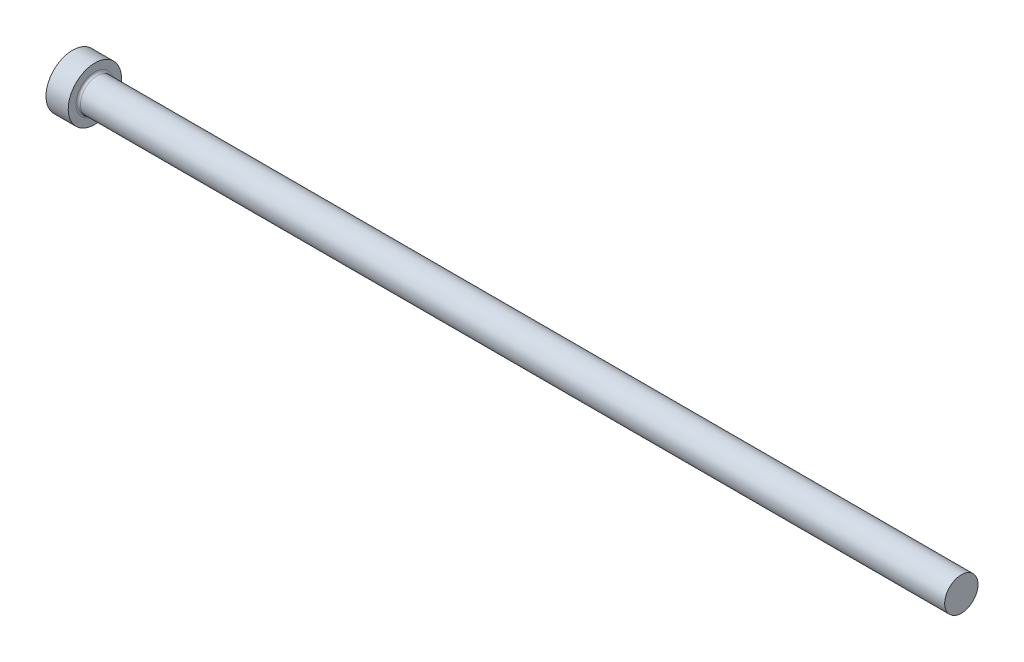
ISO-10303-21;
HEADER;
FILE_DESCRIPTION(('STEP AP214'),'2;1');
FILE_NAME('part.step','',(''),(''),'','','');
FILE_SCHEMA(('AUTOMOTIVE_DESIGN { 1 0 10303 214 1 1 1 1 }'));
ENDSEC;
DATA;
#1=APPLICATION_CONTEXT('core data for automotive mechanical design processes');
#2=APPLICATION_PROTOCOL_DEFINITION('international standard','automotive_design',2000,#1);
#3=PRODUCT_CONTEXT('',#1,'mechanical');
#4=PRODUCT('Part','Part','',(#3));
#5=PRODUCT_RELATED_PRODUCT_CATEGORY('part','',(#4));
#6=PRODUCT_DEFINITION_FORMATION('','',#4);
#7=PRODUCT_DEFINITION_CONTEXT('part definition',#1,'design');
#8=PRODUCT_DEFINITION('design','',#6,#7);
#9=PRODUCT_DEFINITION_SHAPE('','',#8);
#10=(LENGTH_UNIT() NAMED_UNIT(*) SI_UNIT(.MILLI.,.METRE.));
#11=(NAMED_UNIT(*) PLANE_ANGLE_UNIT() SI_UNIT($,.RADIAN.));
#12=(NAMED_UNIT(*) SI_UNIT($,.STERADIAN.) SOLID_ANGLE_UNIT());
#13=UNCERTAINTY_MEASURE_WITH_UNIT(LENGTH_MEASURE(1.E-05),#10,'distance_accuracy_value','');
#14=(GEOMETRIC_REPRESENTATION_CONTEXT(3) GLOBAL_UNCERTAINTY_ASSIGNED_CONTEXT((#13)) GLOBAL_UNIT_ASSIGNED_CONTEXT((#10,
#11,#12)) REPRESENTATION_CONTEXT('',''));
#15=CARTESIAN_POINT('',(0.,0.,0.));
#16=DIRECTION('',(0.,0.,1.));
#17=DIRECTION('',(1.,0.,0.));
#18=AXIS2_PLACEMENT_3D('',#15,#16,#17);
#19=CARTESIAN_POINT('',(0.,0.,0.));
#20=DIRECTION('',(-1.,0.,0.));
#21=DIRECTION('',(0.,-1.,0.));
#22=AXIS2_PLACEMENT_3D('',#19,#20,#21);
#23=PLANE('',#22);
#24=CARTESIAN_POINT('',(0.,0.,0.));
#25=DIRECTION('',(1.,0.,0.));
#26=DIRECTION('',(0.,1.,0.));
#27=AXIS2_PLACEMENT_3D('',#24,#25,#26);
#28=CIRCLE('',#27,6.);
#29=CARTESIAN_POINT('',(0.,6.,0.));
#30=VERTEX_POINT('',#29);
#31=EDGE_CURVE('E25',#30,#30,#28,.T.);
#32=ORIENTED_EDGE('',*,*,#31,.F.);
#33=EDGE_LOOP('',(#32));
#34=FACE_BOUND('',#33,.T.);
#35=ADVANCED_FACE('F14',(#34),#23,.T.);
#36=CARTESIAN_POINT('',(200.,0.,0.));
#37=DIRECTION('',(1.,0.,0.));
#38=DIRECTION('',(0.,1.,0.));
#39=AXIS2_PLACEMENT_3D('',#36,#37,#38);
#40=CYLINDRICAL_SURFACE('',#39,6.);
#41=ORIENTED_EDGE('',*,*,#31,.T.);
#42=EDGE_LOOP('',(#41));
#43=FACE_BOUND('',#42,.T.);
#44=CARTESIAN_POINT('',(5.,0.,0.));
#45=DIRECTION('',(1.,0.,0.));
#46=DIRECTION('',(0.,1.,0.));
#47=AXIS2_PLACEMENT_3D('',#44,#45,#46);
#48=CIRCLE('',#47,6.);
#49=CARTESIAN_POINT('',(5.,6.,0.));
#50=VERTEX_POINT('',#49);
#51=EDGE_CURVE('E29',#50,#50,#48,.T.);
#52=ORIENTED_EDGE('',*,*,#51,.F.);
#53=EDGE_LOOP('',(#52));
#54=FACE_BOUND('',#53,.T.);
#55=ADVANCED_FACE('F51',(#43,#54),#40,.T.);
#56=CARTESIAN_POINT('',(5.,6.,0.));
#57=DIRECTION('',(1.,0.,0.));
#58=DIRECTION('',(0.,1.,0.));
#59=AXIS2_PLACEMENT_3D('',#56,#57,#58);
#60=PLANE('',#59);
#61=CARTESIAN_POINT('',(5.,0.,0.));
#62=DIRECTION('',(1.,0.,0.));
#63=DIRECTION('',(0.,1.,0.));
#64=AXIS2_PLACEMENT_3D('',#61,#62,#63);
#65=CIRCLE('',#64,4.24999999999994);
#66=CARTESIAN_POINT('',(5.,4.24999999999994,0.));
#67=VERTEX_POINT('',#66);
#68=EDGE_CURVE('E9',#67,#67,#65,.F.);
#69=ORIENTED_EDGE('',*,*,#68,.T.);
#70=EDGE_LOOP('',(#69));
#71=FACE_BOUND('',#70,.T.);
#72=ORIENTED_EDGE('',*,*,#51,.T.);
#73=EDGE_LOOP('',(#72));
#74=FACE_BOUND('',#73,.T.);
#75=ADVANCED_FACE('F42',(#71,#74),#60,.T.);
#76=CARTESIAN_POINT('',(200.,0.,0.));
#77=DIRECTION('',(1.,0.,0.));
#78=DIRECTION('',(0.,1.,0.));
#79=AXIS2_PLACEMENT_3D('',#76,#77,#78);
#80=CYLINDRICAL_SURFACE('',#79,3.74999999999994);
#81=CARTESIAN_POINT('',(5.5,0.,0.));
#82=DIRECTION('',(1.,0.,0.));
#83=DIRECTION('',(0.,1.,0.));
#84=AXIS2_PLACEMENT_3D('',#81,#82,#83);
#85=CIRCLE('',#84,3.74999999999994);
#86=CARTESIAN_POINT('',(5.5,3.74999999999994,0.));
#87=VERTEX_POINT('',#86);
#88=EDGE_CURVE('E21',#87,#87,#85,.T.);
#89=ORIENTED_EDGE('',*,*,#88,.T.);
#90=EDGE_LOOP('',(#89));
#91=FACE_BOUND('',#90,.T.);
#92=CARTESIAN_POINT('',(200.,0.,0.));
#93=DIRECTION('',(1.,0.,0.));
#94=DIRECTION('',(0.,1.,0.));
#95=AXIS2_PLACEMENT_3D('',#92,#93,#94);
#96=CIRCLE('',#95,3.75);
#97=CARTESIAN_POINT('',(200.,3.75,0.));
#98=VERTEX_POINT('',#97);
#99=EDGE_CURVE('E34',#98,#98,#96,.T.);
#100=ORIENTED_EDGE('',*,*,#99,.F.);
#101=EDGE_LOOP('',(#100));
#102=FACE_BOUND('',#101,.T.);
#103=ADVANCED_FACE('F40',(#91,#102),#80,.T.);
#104=CARTESIAN_POINT('',(200.,3.75,0.));
#105=DIRECTION('',(1.,0.,0.));
#106=DIRECTION('',(0.,1.,0.));
#107=AXIS2_PLACEMENT_3D('',#104,#105,#106);
#108=PLANE('',#107);
#109=ORIENTED_EDGE('',*,*,#99,.T.);
#110=EDGE_LOOP('',(#109));
#111=FACE_BOUND('',#110,.T.);
#112=ADVANCED_FACE('F38',(#111),#108,.T.);
#113=CARTESIAN_POINT('',(5.5,0.,0.));
#114=DIRECTION('',(1.,0.,0.));
#115=DIRECTION('',(0.,1.,0.));
#116=AXIS2_PLACEMENT_3D('',#113,#114,#115);
#117=TOROIDAL_SURFACE('',#116,4.24999999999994,0.5);
#118=ORIENTED_EDGE('',*,*,#68,.F.);
#119=EDGE_LOOP('',(#118));
#120=FACE_BOUND('',#119,.T.);
#121=ORIENTED_EDGE('',*,*,#88,.F.);
#122=EDGE_LOOP('',(#121));
#123=FACE_BOUND('',#122,.T.);
#124=ADVANCED_FACE('F16',(#120,#123),#117,.F.);
#125=CLOSED_SHELL('',(#35,#55,#75,#103,#112,#124));
#126=MANIFOLD_SOLID_BREP('B1',#125);
#127=ADVANCED_BREP_SHAPE_REPRESENTATION('',(#18,#126),#14);
#128=SHAPE_DEFINITION_REPRESENTATION(#9,#127);
ENDSEC;
END-ISO-10303-21;
